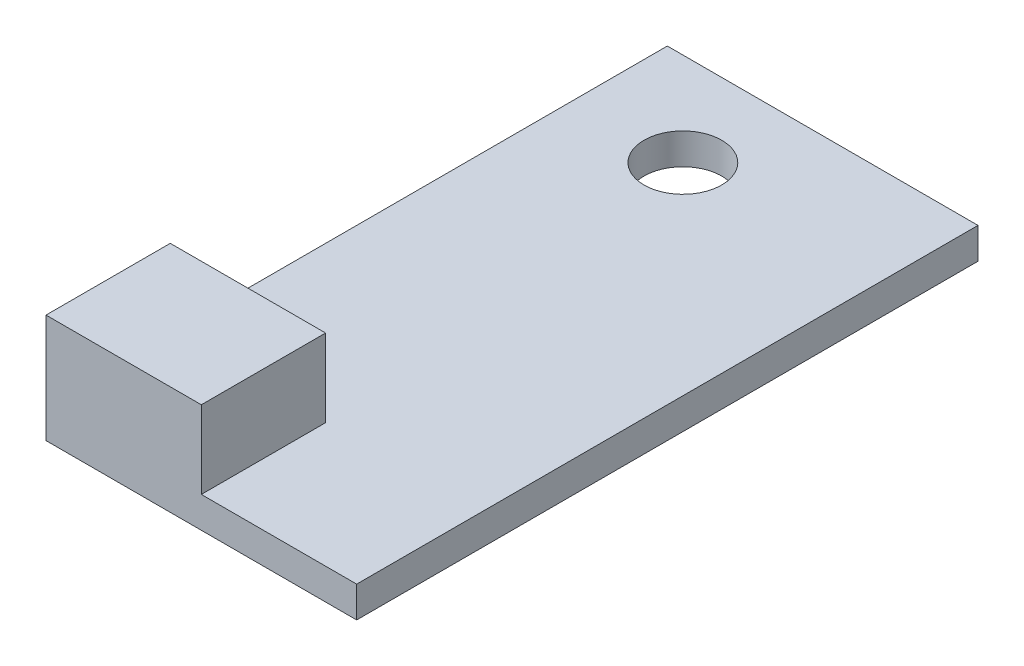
from build123d import *

# Parameters (mm, degrees)
SKETCH1_W                  = 100
SKETCH1_H                  = 200
BOSS_EXTRUDE1_DEPTH        = 10
SKETCH2_W                  = 50
SKETCH2_H                  = 40
BOSS_EXTRUDE2_DEPTH        = 25
F_25_0_25_DIAMETER_HOLE1_D = 25


with BuildPart() as part:
    # Sketch1 → Boss-Extrude1 (new body)
    with BuildSketch(Plane(origin=(0, 0, 0), x_dir=(1, 0, 0), z_dir=(0, 1, 0))):
        with Locations((50, 100)):
            Rectangle(SKETCH1_W, SKETCH1_H)
    extrude(amount=BOSS_EXTRUDE1_DEPTH)

    # Sketch2 → Boss-Extrude2 (add)
    with BuildSketch(Plane(origin=(0, 10, 0), x_dir=(1, 0, 0), z_dir=(0, 1, 0))):
        with Locations((25, 20)):
            Rectangle(SKETCH2_W, SKETCH2_H)
    extrude(amount=BOSS_EXTRUDE2_DEPTH)

    # 25.0 _25_ Diameter Hole1 (through all)
    with Locations(Plane(origin=(0, 10, 0), x_dir=(1, 0, 0), z_dir=(0, 1, 0))):
        with Locations((35, 170)):
            Hole(F_25_0_25_DIAMETER_HOLE1_D / 2)


solid = part.part
